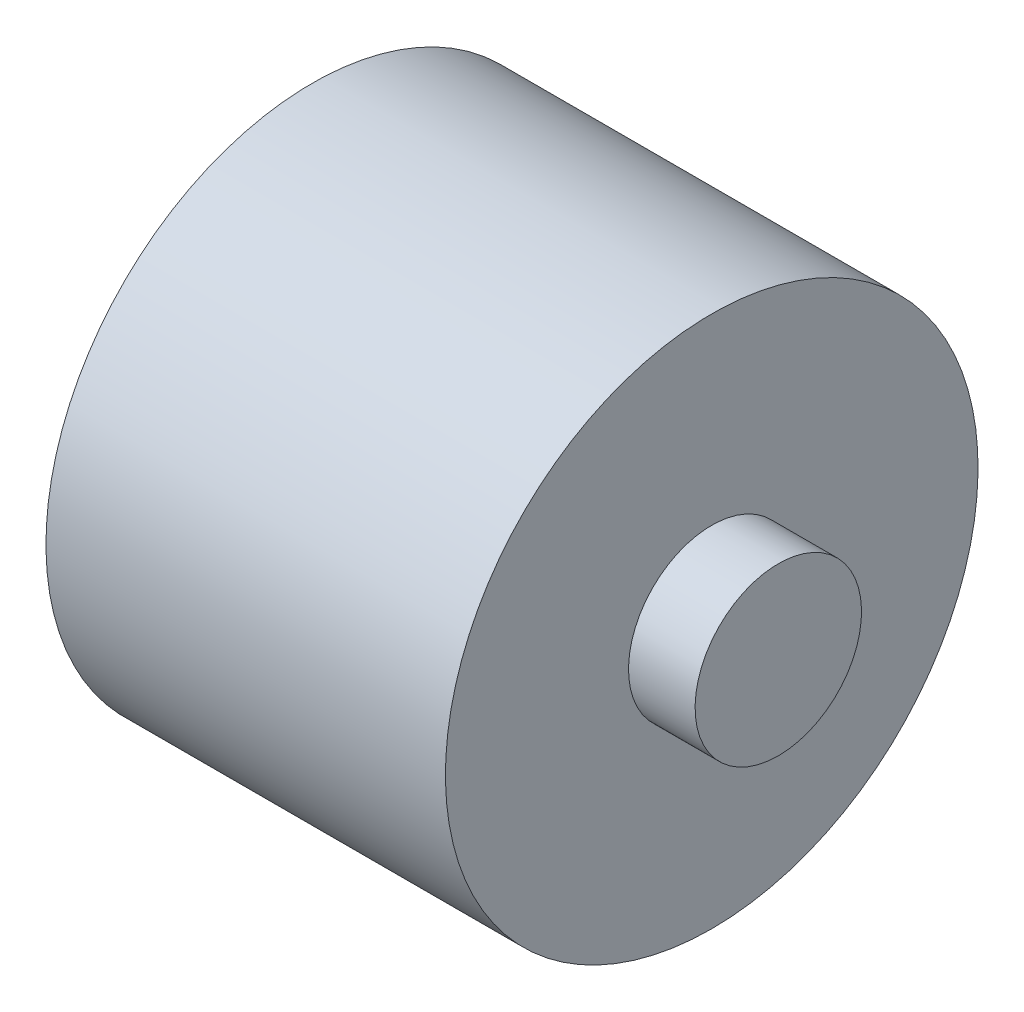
from build123d import *


with BuildPart() as part:
    # Sketch1 → Revolve1 (revolve)
    with BuildSketch(Plane.XY, mode=Mode.PRIVATE) as revolve1_sk:
        Polygon((-4, 0), (-4, 1.25), (-3, 1.25), (-3, 4), (3, 4), (3, 1.25), (4, 1.25), (4, 0), align=None)
    revolve(revolve1_sk.sketch.rotate(Axis((-4, 0, 0), (1, 0, 0)), 180), axis=Axis((-4, 0, 0), (1, 0, 0)))


solid = part.part
